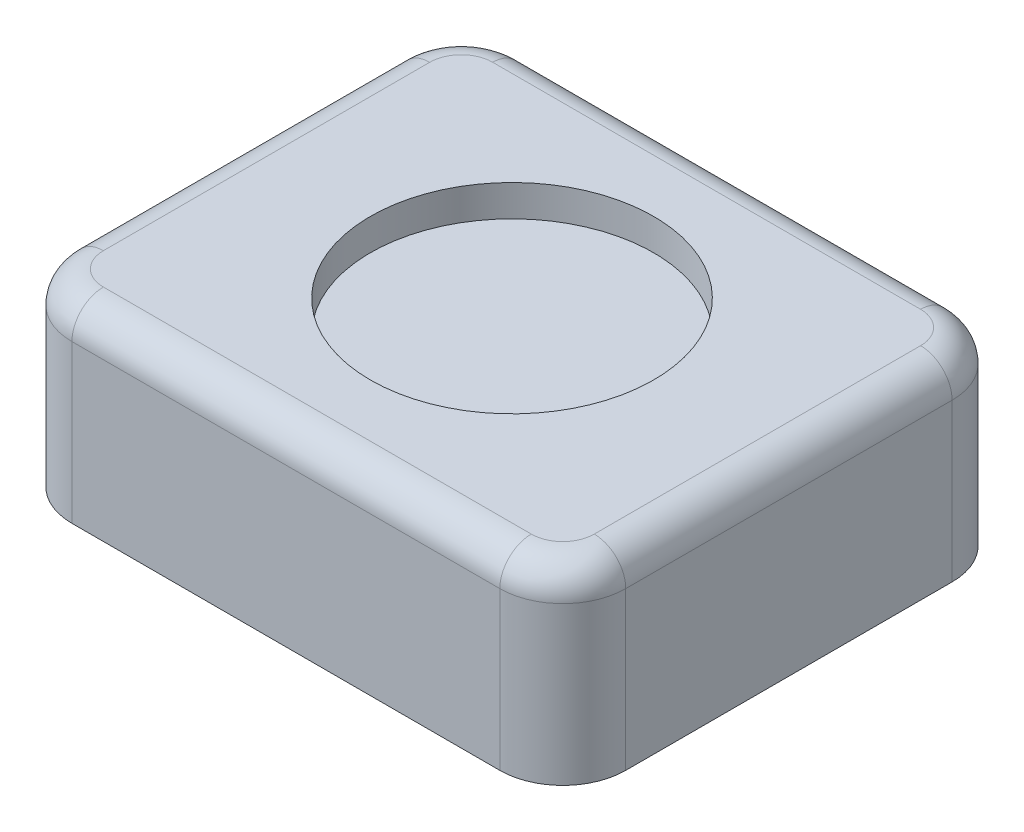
ISO-10303-21;
HEADER;
FILE_DESCRIPTION(('STEP AP214'),'2;1');
FILE_NAME('part.step','',(''),(''),'','','');
FILE_SCHEMA(('AUTOMOTIVE_DESIGN { 1 0 10303 214 1 1 1 1 }'));
ENDSEC;
DATA;
#1=APPLICATION_CONTEXT('core data for automotive mechanical design processes');
#2=APPLICATION_PROTOCOL_DEFINITION('international standard','automotive_design',2000,#1);
#3=PRODUCT_CONTEXT('',#1,'mechanical');
#4=PRODUCT('Part','Part','',(#3));
#5=PRODUCT_RELATED_PRODUCT_CATEGORY('part','',(#4));
#6=PRODUCT_DEFINITION_FORMATION('','',#4);
#7=PRODUCT_DEFINITION_CONTEXT('part definition',#1,'design');
#8=PRODUCT_DEFINITION('design','',#6,#7);
#9=PRODUCT_DEFINITION_SHAPE('','',#8);
#10=(LENGTH_UNIT() NAMED_UNIT(*) SI_UNIT(.MILLI.,.METRE.));
#11=(NAMED_UNIT(*) PLANE_ANGLE_UNIT() SI_UNIT($,.RADIAN.));
#12=(NAMED_UNIT(*) SI_UNIT($,.STERADIAN.) SOLID_ANGLE_UNIT());
#13=UNCERTAINTY_MEASURE_WITH_UNIT(LENGTH_MEASURE(1.E-05),#10,'distance_accuracy_value','');
#14=(GEOMETRIC_REPRESENTATION_CONTEXT(3) GLOBAL_UNCERTAINTY_ASSIGNED_CONTEXT((#13)) GLOBAL_UNIT_ASSIGNED_CONTEXT((#10,
#11,#12)) REPRESENTATION_CONTEXT('',''));
#15=CARTESIAN_POINT('',(0.,0.,0.));
#16=DIRECTION('',(0.,0.,1.));
#17=DIRECTION('',(1.,0.,0.));
#18=AXIS2_PLACEMENT_3D('',#15,#16,#17);
#19=CARTESIAN_POINT('',(0.,30.,0.));
#20=DIRECTION('',(1.,0.,0.));
#21=DIRECTION('',(0.,0.,-1.));
#22=AXIS2_PLACEMENT_3D('',#19,#20,#21);
#23=PLANE('',#22);
#24=DIRECTION('',(0.,-1.,0.));
#25=VECTOR('',#24,1.);
#26=CARTESIAN_POINT('',(0.,30.,-10.));
#27=LINE('',#26,#25);
#28=CARTESIAN_POINT('',(0.,0.,-10.));
#29=VERTEX_POINT('',#28);
#30=CARTESIAN_POINT('',(0.,25.,-10.));
#31=VERTEX_POINT('',#30);
#32=EDGE_CURVE('E135',#29,#31,#27,.F.);
#33=ORIENTED_EDGE('',*,*,#32,.T.);
#34=DIRECTION('',(0.,0.,1.));
#35=VECTOR('',#34,1.);
#36=CARTESIAN_POINT('',(0.,25.,0.));
#37=LINE('',#36,#35);
#38=CARTESIAN_POINT('',(0.,25.,-61.8233067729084));
#39=VERTEX_POINT('',#38);
#40=EDGE_CURVE('E131',#31,#39,#37,.F.);
#41=ORIENTED_EDGE('',*,*,#40,.T.);
#42=DIRECTION('',(0.,-1.,0.));
#43=VECTOR('',#42,1.);
#44=CARTESIAN_POINT('',(0.,30.,-61.8233067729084));
#45=LINE('',#44,#43);
#46=CARTESIAN_POINT('',(0.,0.,-61.8233067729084));
#47=VERTEX_POINT('',#46);
#48=EDGE_CURVE('E124',#39,#47,#45,.T.);
#49=ORIENTED_EDGE('',*,*,#48,.T.);
#50=DIRECTION('',(0.,0.,1.));
#51=VECTOR('',#50,1.);
#52=CARTESIAN_POINT('',(0.,0.,0.));
#53=LINE('',#52,#51);
#54=EDGE_CURVE('E128',#47,#29,#53,.T.);
#55=ORIENTED_EDGE('',*,*,#54,.T.);
#56=EDGE_LOOP('',(#33,#41,#49,#55));
#57=FACE_BOUND('',#56,.T.);
#58=ADVANCED_FACE('F33',(#57),#23,.F.);
#59=CARTESIAN_POINT('',(0.,30.,0.));
#60=DIRECTION('',(0.,0.,-1.));
#61=DIRECTION('',(-1.,0.,0.));
#62=AXIS2_PLACEMENT_3D('',#59,#60,#61);
#63=PLANE('',#62);
#64=DIRECTION('',(0.,-1.,0.));
#65=VECTOR('',#64,1.);
#66=CARTESIAN_POINT('',(77.9512948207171,30.,0.));
#67=LINE('',#66,#65);
#68=CARTESIAN_POINT('',(77.9512948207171,0.,0.));
#69=VERTEX_POINT('',#68);
#70=CARTESIAN_POINT('',(77.9512948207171,25.,0.));
#71=VERTEX_POINT('',#70);
#72=EDGE_CURVE('E179',#69,#71,#67,.F.);
#73=ORIENTED_EDGE('',*,*,#72,.T.);
#74=DIRECTION('',(1.,0.,0.));
#75=VECTOR('',#74,1.);
#76=CARTESIAN_POINT('',(0.,25.,0.));
#77=LINE('',#76,#75);
#78=CARTESIAN_POINT('',(10.,25.,0.));
#79=VERTEX_POINT('',#78);
#80=EDGE_CURVE('E11',#71,#79,#77,.F.);
#81=ORIENTED_EDGE('',*,*,#80,.T.);
#82=DIRECTION('',(0.,-1.,0.));
#83=VECTOR('',#82,1.);
#84=CARTESIAN_POINT('',(10.,30.,0.));
#85=LINE('',#84,#83);
#86=CARTESIAN_POINT('',(10.,0.,0.));
#87=VERTEX_POINT('',#86);
#88=EDGE_CURVE('E177',#79,#87,#85,.T.);
#89=ORIENTED_EDGE('',*,*,#88,.T.);
#90=DIRECTION('',(1.,0.,0.));
#91=VECTOR('',#90,1.);
#92=CARTESIAN_POINT('',(0.,0.,0.));
#93=LINE('',#92,#91);
#94=EDGE_CURVE('E151',#87,#69,#93,.T.);
#95=ORIENTED_EDGE('',*,*,#94,.T.);
#96=EDGE_LOOP('',(#73,#81,#89,#95));
#97=FACE_BOUND('',#96,.T.);
#98=ADVANCED_FACE('F251',(#97),#63,.F.);
#99=CARTESIAN_POINT('',(87.9512948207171,30.,0.));
#100=DIRECTION('',(-1.,0.,0.));
#101=DIRECTION('',(0.,0.,1.));
#102=AXIS2_PLACEMENT_3D('',#99,#100,#101);
#103=PLANE('',#102);
#104=DIRECTION('',(0.,-1.,0.));
#105=VECTOR('',#104,1.);
#106=CARTESIAN_POINT('',(87.9512948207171,30.,-61.8233067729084));
#107=LINE('',#106,#105);
#108=CARTESIAN_POINT('',(87.9512948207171,0.,-61.8233067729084));
#109=VERTEX_POINT('',#108);
#110=CARTESIAN_POINT('',(87.9512948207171,25.,-61.8233067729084));
#111=VERTEX_POINT('',#110);
#112=EDGE_CURVE('E175',#109,#111,#107,.F.);
#113=ORIENTED_EDGE('',*,*,#112,.T.);
#114=DIRECTION('',(0.,0.,-1.));
#115=VECTOR('',#114,1.);
#116=CARTESIAN_POINT('',(87.9512948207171,25.,0.));
#117=LINE('',#116,#115);
#118=CARTESIAN_POINT('',(87.9512948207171,25.,-10.));
#119=VERTEX_POINT('',#118);
#120=EDGE_CURVE('E57',#111,#119,#117,.F.);
#121=ORIENTED_EDGE('',*,*,#120,.T.);
#122=DIRECTION('',(0.,-1.,0.));
#123=VECTOR('',#122,1.);
#124=CARTESIAN_POINT('',(87.9512948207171,30.,-10.));
#125=LINE('',#124,#123);
#126=CARTESIAN_POINT('',(87.9512948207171,0.,-10.));
#127=VERTEX_POINT('',#126);
#128=EDGE_CURVE('E173',#119,#127,#125,.T.);
#129=ORIENTED_EDGE('',*,*,#128,.T.);
#130=DIRECTION('',(0.,0.,-1.));
#131=VECTOR('',#130,1.);
#132=CARTESIAN_POINT('',(87.9512948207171,0.,0.));
#133=LINE('',#132,#131);
#134=EDGE_CURVE('E154',#127,#109,#133,.T.);
#135=ORIENTED_EDGE('',*,*,#134,.T.);
#136=EDGE_LOOP('',(#113,#121,#129,#135));
#137=FACE_BOUND('',#136,.T.);
#138=ADVANCED_FACE('F283',(#137),#103,.F.);
#139=CARTESIAN_POINT('',(0.,30.,-71.8233067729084));
#140=DIRECTION('',(0.,0.,1.));
#141=DIRECTION('',(1.,0.,0.));
#142=AXIS2_PLACEMENT_3D('',#139,#140,#141);
#143=PLANE('',#142);
#144=DIRECTION('',(0.,-1.,0.));
#145=VECTOR('',#144,1.);
#146=CARTESIAN_POINT('',(10.,30.,-71.8233067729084));
#147=LINE('',#146,#145);
#148=CARTESIAN_POINT('',(10.,0.,-71.8233067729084));
#149=VERTEX_POINT('',#148);
#150=CARTESIAN_POINT('',(10.,25.,-71.8233067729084));
#151=VERTEX_POINT('',#150);
#152=EDGE_CURVE('E141',#149,#151,#147,.F.);
#153=ORIENTED_EDGE('',*,*,#152,.T.);
#154=DIRECTION('',(-1.,0.,0.));
#155=VECTOR('',#154,1.);
#156=CARTESIAN_POINT('',(0.,25.,-71.8233067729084));
#157=LINE('',#156,#155);
#158=CARTESIAN_POINT('',(77.9512948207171,25.,-71.8233067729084));
#159=VERTEX_POINT('',#158);
#160=EDGE_CURVE('E204',#151,#159,#157,.F.);
#161=ORIENTED_EDGE('',*,*,#160,.T.);
#162=DIRECTION('',(0.,-1.,0.));
#163=VECTOR('',#162,1.);
#164=CARTESIAN_POINT('',(77.9512948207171,30.,-71.8233067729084));
#165=LINE('',#164,#163);
#166=CARTESIAN_POINT('',(77.9512948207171,0.,-71.8233067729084));
#167=VERTEX_POINT('',#166);
#168=EDGE_CURVE('E145',#159,#167,#165,.T.);
#169=ORIENTED_EDGE('',*,*,#168,.T.);
#170=DIRECTION('',(-1.,0.,0.));
#171=VECTOR('',#170,1.);
#172=CARTESIAN_POINT('',(0.,0.,-71.8233067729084));
#173=LINE('',#172,#171);
#174=EDGE_CURVE('E164',#167,#149,#173,.T.);
#175=ORIENTED_EDGE('',*,*,#174,.T.);
#176=EDGE_LOOP('',(#153,#161,#169,#175));
#177=FACE_BOUND('',#176,.T.);
#178=ADVANCED_FACE('F268',(#177),#143,.F.);
#179=CARTESIAN_POINT('',(0.,30.,-71.8233067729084));
#180=DIRECTION('',(0.,-1.,0.));
#181=DIRECTION('',(0.,0.,-1.));
#182=AXIS2_PLACEMENT_3D('',#179,#180,#181);
#183=PLANE('',#182);
#184=CARTESIAN_POINT('',(43.9756474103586,30.,-35.9116533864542));
#185=DIRECTION('',(0.,1.,0.));
#186=DIRECTION('',(0.,0.,1.));
#187=AXIS2_PLACEMENT_3D('',#184,#185,#186);
#188=CIRCLE('',#187,22.5);
#189=CARTESIAN_POINT('',(43.9756474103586,30.,-13.4116533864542));
#190=VERTEX_POINT('',#189);
#191=EDGE_CURVE('E159',#190,#190,#188,.T.);
#192=ORIENTED_EDGE('',*,*,#191,.F.);
#193=EDGE_LOOP('',(#192));
#194=FACE_BOUND('',#193,.T.);
#195=DIRECTION('',(0.,0.,1.));
#196=VECTOR('',#195,1.);
#197=CARTESIAN_POINT('',(5.,30.,-71.8233067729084));
#198=LINE('',#197,#196);
#199=CARTESIAN_POINT('',(5.,30.,-61.8233067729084));
#200=VERTEX_POINT('',#199);
#201=CARTESIAN_POINT('',(5.,30.,-10.));
#202=VERTEX_POINT('',#201);
#203=EDGE_CURVE('E193',#200,#202,#198,.T.);
#204=ORIENTED_EDGE('',*,*,#203,.T.);
#205=CARTESIAN_POINT('',(10.,30.,-10.));
#206=DIRECTION('',(0.,-1.,0.));
#207=DIRECTION('',(0.,0.,-1.));
#208=AXIS2_PLACEMENT_3D('',#205,#206,#207);
#209=CIRCLE('',#208,5.);
#210=CARTESIAN_POINT('',(10.,30.,-5.));
#211=VERTEX_POINT('',#210);
#212=EDGE_CURVE('E195',#202,#211,#209,.F.);
#213=ORIENTED_EDGE('',*,*,#212,.T.);
#214=DIRECTION('',(1.,0.,0.));
#215=VECTOR('',#214,1.);
#216=CARTESIAN_POINT('',(0.,30.,-5.));
#217=LINE('',#216,#215);
#218=CARTESIAN_POINT('',(77.9512948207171,30.,-5.));
#219=VERTEX_POINT('',#218);
#220=EDGE_CURVE('E181',#211,#219,#217,.T.);
#221=ORIENTED_EDGE('',*,*,#220,.T.);
#222=CARTESIAN_POINT('',(77.9512948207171,30.,-10.));
#223=DIRECTION('',(0.,-1.,0.));
#224=DIRECTION('',(0.,0.,-1.));
#225=AXIS2_PLACEMENT_3D('',#222,#223,#224);
#226=CIRCLE('',#225,5.);
#227=CARTESIAN_POINT('',(82.9512948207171,30.,-10.));
#228=VERTEX_POINT('',#227);
#229=EDGE_CURVE('E183',#219,#228,#226,.F.);
#230=ORIENTED_EDGE('',*,*,#229,.T.);
#231=DIRECTION('',(0.,0.,-1.));
#232=VECTOR('',#231,1.);
#233=CARTESIAN_POINT('',(82.9512948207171,30.,-71.8233067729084));
#234=LINE('',#233,#232);
#235=CARTESIAN_POINT('',(82.9512948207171,30.,-61.8233067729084));
#236=VERTEX_POINT('',#235);
#237=EDGE_CURVE('E185',#228,#236,#234,.T.);
#238=ORIENTED_EDGE('',*,*,#237,.T.);
#239=CARTESIAN_POINT('',(77.9512948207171,30.,-61.8233067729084));
#240=DIRECTION('',(0.,-1.,0.));
#241=DIRECTION('',(0.,0.,-1.));
#242=AXIS2_PLACEMENT_3D('',#239,#240,#241);
#243=CIRCLE('',#242,5.);
#244=CARTESIAN_POINT('',(77.9512948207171,30.,-66.8233067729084));
#245=VERTEX_POINT('',#244);
#246=EDGE_CURVE('E187',#236,#245,#243,.F.);
#247=ORIENTED_EDGE('',*,*,#246,.T.);
#248=DIRECTION('',(-1.,0.,0.));
#249=VECTOR('',#248,1.);
#250=CARTESIAN_POINT('',(0.,30.,-66.8233067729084));
#251=LINE('',#250,#249);
#252=CARTESIAN_POINT('',(10.,30.,-66.8233067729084));
#253=VERTEX_POINT('',#252);
#254=EDGE_CURVE('E189',#245,#253,#251,.T.);
#255=ORIENTED_EDGE('',*,*,#254,.T.);
#256=CARTESIAN_POINT('',(10.,30.,-61.8233067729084));
#257=DIRECTION('',(0.,-1.,0.));
#258=DIRECTION('',(0.,0.,-1.));
#259=AXIS2_PLACEMENT_3D('',#256,#257,#258);
#260=CIRCLE('',#259,5.);
#261=EDGE_CURVE('E191',#253,#200,#260,.F.);
#262=ORIENTED_EDGE('',*,*,#261,.T.);
#263=EDGE_LOOP('',(#204,#213,#221,#230,#238,#247,#255,#262));
#264=FACE_BOUND('',#263,.T.);
#265=ADVANCED_FACE('F238',(#194,#264),#183,.F.);
#266=CARTESIAN_POINT('',(0.,0.,-71.8233067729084));
#267=DIRECTION('',(0.,-1.,0.));
#268=DIRECTION('',(0.,0.,-1.));
#269=AXIS2_PLACEMENT_3D('',#266,#267,#268);
#270=PLANE('',#269);
#271=ORIENTED_EDGE('',*,*,#54,.F.);
#272=CARTESIAN_POINT('',(10.,0.,-61.8233067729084));
#273=DIRECTION('',(0.,-1.,0.));
#274=DIRECTION('',(0.,0.,-1.));
#275=AXIS2_PLACEMENT_3D('',#272,#273,#274);
#276=CIRCLE('',#275,10.);
#277=EDGE_CURVE('E138',#47,#149,#276,.T.);
#278=ORIENTED_EDGE('',*,*,#277,.T.);
#279=ORIENTED_EDGE('',*,*,#174,.F.);
#280=CARTESIAN_POINT('',(77.9512948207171,0.,-61.8233067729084));
#281=DIRECTION('',(0.,-1.,0.));
#282=DIRECTION('',(0.,0.,-1.));
#283=AXIS2_PLACEMENT_3D('',#280,#281,#282);
#284=CIRCLE('',#283,10.);
#285=EDGE_CURVE('E146',#167,#109,#284,.T.);
#286=ORIENTED_EDGE('',*,*,#285,.T.);
#287=ORIENTED_EDGE('',*,*,#134,.F.);
#288=CARTESIAN_POINT('',(77.9512948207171,0.,-10.));
#289=DIRECTION('',(0.,-1.,0.));
#290=DIRECTION('',(0.,0.,-1.));
#291=AXIS2_PLACEMENT_3D('',#288,#289,#290);
#292=CIRCLE('',#291,10.);
#293=EDGE_CURVE('E168',#127,#69,#292,.T.);
#294=ORIENTED_EDGE('',*,*,#293,.T.);
#295=ORIENTED_EDGE('',*,*,#94,.F.);
#296=CARTESIAN_POINT('',(10.,0.,-10.));
#297=DIRECTION('',(0.,-1.,0.));
#298=DIRECTION('',(0.,0.,-1.));
#299=AXIS2_PLACEMENT_3D('',#296,#297,#298);
#300=CIRCLE('',#299,10.);
#301=EDGE_CURVE('E134',#87,#29,#300,.T.);
#302=ORIENTED_EDGE('',*,*,#301,.T.);
#303=EDGE_LOOP('',(#271,#278,#279,#286,#287,#294,#295,#302));
#304=FACE_BOUND('',#303,.T.);
#305=ADVANCED_FACE('F148',(#304),#270,.T.);
#306=CARTESIAN_POINT('',(10.,30.,-61.8233067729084));
#307=DIRECTION('',(0.,-1.,0.));
#308=DIRECTION('',(0.,0.,-1.));
#309=AXIS2_PLACEMENT_3D('',#306,#307,#308);
#310=CYLINDRICAL_SURFACE('',#309,10.);
#311=ORIENTED_EDGE('',*,*,#48,.F.);
#312=CARTESIAN_POINT('',(10.,25.,-61.8233067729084));
#313=DIRECTION('',(0.,-1.,0.));
#314=DIRECTION('',(0.,0.,-1.));
#315=AXIS2_PLACEMENT_3D('',#312,#313,#314);
#316=CIRCLE('',#315,10.);
#317=EDGE_CURVE('E202',#39,#151,#316,.T.);
#318=ORIENTED_EDGE('',*,*,#317,.T.);
#319=ORIENTED_EDGE('',*,*,#152,.F.);
#320=ORIENTED_EDGE('',*,*,#277,.F.);
#321=EDGE_LOOP('',(#311,#318,#319,#320));
#322=FACE_BOUND('',#321,.T.);
#323=ADVANCED_FACE('F139',(#322),#310,.T.);
#324=CARTESIAN_POINT('',(77.9512948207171,30.,-61.8233067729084));
#325=DIRECTION('',(0.,-1.,0.));
#326=DIRECTION('',(0.,0.,-1.));
#327=AXIS2_PLACEMENT_3D('',#324,#325,#326);
#328=CYLINDRICAL_SURFACE('',#327,10.);
#329=ORIENTED_EDGE('',*,*,#168,.F.);
#330=CARTESIAN_POINT('',(77.9512948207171,25.,-61.8233067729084));
#331=DIRECTION('',(0.,-1.,0.));
#332=DIRECTION('',(0.,0.,-1.));
#333=AXIS2_PLACEMENT_3D('',#330,#331,#332);
#334=CIRCLE('',#333,10.);
#335=EDGE_CURVE('E206',#159,#111,#334,.T.);
#336=ORIENTED_EDGE('',*,*,#335,.T.);
#337=ORIENTED_EDGE('',*,*,#112,.F.);
#338=ORIENTED_EDGE('',*,*,#285,.F.);
#339=EDGE_LOOP('',(#329,#336,#337,#338));
#340=FACE_BOUND('',#339,.T.);
#341=ADVANCED_FACE('F289',(#340),#328,.T.);
#342=CARTESIAN_POINT('',(77.9512948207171,30.,-10.));
#343=DIRECTION('',(0.,-1.,0.));
#344=DIRECTION('',(0.,0.,-1.));
#345=AXIS2_PLACEMENT_3D('',#342,#343,#344);
#346=CYLINDRICAL_SURFACE('',#345,10.);
#347=ORIENTED_EDGE('',*,*,#128,.F.);
#348=CARTESIAN_POINT('',(77.9512948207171,25.,-10.));
#349=DIRECTION('',(0.,-1.,0.));
#350=DIRECTION('',(0.,0.,-1.));
#351=AXIS2_PLACEMENT_3D('',#348,#349,#350);
#352=CIRCLE('',#351,10.);
#353=EDGE_CURVE('E42',#119,#71,#352,.T.);
#354=ORIENTED_EDGE('',*,*,#353,.T.);
#355=ORIENTED_EDGE('',*,*,#72,.F.);
#356=ORIENTED_EDGE('',*,*,#293,.F.);
#357=EDGE_LOOP('',(#347,#354,#355,#356));
#358=FACE_BOUND('',#357,.T.);
#359=ADVANCED_FACE('F292',(#358),#346,.T.);
#360=CARTESIAN_POINT('',(10.,30.,-10.));
#361=DIRECTION('',(0.,-1.,0.));
#362=DIRECTION('',(0.,0.,-1.));
#363=AXIS2_PLACEMENT_3D('',#360,#361,#362);
#364=CYLINDRICAL_SURFACE('',#363,10.);
#365=ORIENTED_EDGE('',*,*,#88,.F.);
#366=CARTESIAN_POINT('',(10.,25.,-10.));
#367=DIRECTION('',(0.,-1.,0.));
#368=DIRECTION('',(0.,0.,-1.));
#369=AXIS2_PLACEMENT_3D('',#366,#367,#368);
#370=CIRCLE('',#369,10.);
#371=EDGE_CURVE('E198',#79,#31,#370,.T.);
#372=ORIENTED_EDGE('',*,*,#371,.T.);
#373=ORIENTED_EDGE('',*,*,#32,.F.);
#374=ORIENTED_EDGE('',*,*,#301,.F.);
#375=EDGE_LOOP('',(#365,#372,#373,#374));
#376=FACE_BOUND('',#375,.T.);
#377=ADVANCED_FACE('F254',(#376),#364,.T.);
#378=CARTESIAN_POINT('',(77.9512948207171,25.,-61.8233067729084));
#379=DIRECTION('',(0.,-1.,0.));
#380=DIRECTION('',(0.,0.,-1.));
#381=AXIS2_PLACEMENT_3D('',#378,#379,#380);
#382=DEGENERATE_TOROIDAL_SURFACE('',#381,5.,5.,.T.);
#383=CARTESIAN_POINT('',(82.9512948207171,25.,-61.8233067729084));
#384=DIRECTION('',(0.,0.,1.));
#385=DIRECTION('',(1.,0.,0.));
#386=AXIS2_PLACEMENT_3D('',#383,#384,#385);
#387=CIRCLE('',#386,5.);
#388=EDGE_CURVE('E157',#111,#236,#387,.T.);
#389=ORIENTED_EDGE('',*,*,#388,.F.);
#390=ORIENTED_EDGE('',*,*,#335,.F.);
#391=CARTESIAN_POINT('',(77.9512948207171,25.,-66.8233067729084));
#392=DIRECTION('',(-1.,0.,0.));
#393=DIRECTION('',(0.,0.,1.));
#394=AXIS2_PLACEMENT_3D('',#391,#392,#393);
#395=CIRCLE('',#394,5.);
#396=EDGE_CURVE('E37',#245,#159,#395,.T.);
#397=ORIENTED_EDGE('',*,*,#396,.F.);
#398=ORIENTED_EDGE('',*,*,#246,.F.);
#399=EDGE_LOOP('',(#389,#390,#397,#398));
#400=FACE_BOUND('',#399,.T.);
#401=ADVANCED_FACE('F35',(#400),#382,.T.);
#402=CARTESIAN_POINT('',(0.,25.,-66.8233067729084));
#403=DIRECTION('',(-1.,0.,0.));
#404=DIRECTION('',(0.,0.,1.));
#405=AXIS2_PLACEMENT_3D('',#402,#403,#404);
#406=CYLINDRICAL_SURFACE('',#405,5.);
#407=ORIENTED_EDGE('',*,*,#396,.T.);
#408=ORIENTED_EDGE('',*,*,#160,.F.);
#409=CARTESIAN_POINT('',(10.,25.,-66.8233067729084));
#410=DIRECTION('',(-1.,0.,0.));
#411=DIRECTION('',(0.,0.,1.));
#412=AXIS2_PLACEMENT_3D('',#409,#410,#411);
#413=CIRCLE('',#412,5.);
#414=EDGE_CURVE('E224',#253,#151,#413,.T.);
#415=ORIENTED_EDGE('',*,*,#414,.F.);
#416=ORIENTED_EDGE('',*,*,#254,.F.);
#417=EDGE_LOOP('',(#407,#408,#415,#416));
#418=FACE_BOUND('',#417,.T.);
#419=ADVANCED_FACE('F271',(#418),#406,.T.);
#420=CARTESIAN_POINT('',(82.9512948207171,25.,-71.8233067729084));
#421=DIRECTION('',(0.,0.,-1.));
#422=DIRECTION('',(-1.,0.,0.));
#423=AXIS2_PLACEMENT_3D('',#420,#421,#422);
#424=CYLINDRICAL_SURFACE('',#423,5.);
#425=ORIENTED_EDGE('',*,*,#388,.T.);
#426=ORIENTED_EDGE('',*,*,#237,.F.);
#427=CARTESIAN_POINT('',(82.9512948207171,25.,-10.));
#428=DIRECTION('',(0.,0.,1.));
#429=DIRECTION('',(1.,0.,0.));
#430=AXIS2_PLACEMENT_3D('',#427,#428,#429);
#431=CIRCLE('',#430,5.);
#432=EDGE_CURVE('E221',#119,#228,#431,.T.);
#433=ORIENTED_EDGE('',*,*,#432,.F.);
#434=ORIENTED_EDGE('',*,*,#120,.F.);
#435=EDGE_LOOP('',(#425,#426,#433,#434));
#436=FACE_BOUND('',#435,.T.);
#437=ADVANCED_FACE('F230',(#436),#424,.T.);
#438=CARTESIAN_POINT('',(10.,25.,-61.8233067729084));
#439=DIRECTION('',(0.,-1.,0.));
#440=DIRECTION('',(0.,0.,-1.));
#441=AXIS2_PLACEMENT_3D('',#438,#439,#440);
#442=DEGENERATE_TOROIDAL_SURFACE('',#441,5.,5.,.T.);
#443=ORIENTED_EDGE('',*,*,#414,.T.);
#444=ORIENTED_EDGE('',*,*,#317,.F.);
#445=CARTESIAN_POINT('',(5.,25.,-61.8233067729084));
#446=DIRECTION('',(0.,0.,1.));
#447=DIRECTION('',(1.,0.,0.));
#448=AXIS2_PLACEMENT_3D('',#445,#446,#447);
#449=CIRCLE('',#448,5.);
#450=EDGE_CURVE('E218',#200,#39,#449,.T.);
#451=ORIENTED_EDGE('',*,*,#450,.F.);
#452=ORIENTED_EDGE('',*,*,#261,.F.);
#453=EDGE_LOOP('',(#443,#444,#451,#452));
#454=FACE_BOUND('',#453,.T.);
#455=ADVANCED_FACE('F265',(#454),#442,.T.);
#456=CARTESIAN_POINT('',(77.9512948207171,25.,-10.));
#457=DIRECTION('',(0.,-1.,0.));
#458=DIRECTION('',(0.,0.,-1.));
#459=AXIS2_PLACEMENT_3D('',#456,#457,#458);
#460=DEGENERATE_TOROIDAL_SURFACE('',#459,5.,5.,.T.);
#461=ORIENTED_EDGE('',*,*,#432,.T.);
#462=ORIENTED_EDGE('',*,*,#229,.F.);
#463=CARTESIAN_POINT('',(77.9512948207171,25.,-5.));
#464=DIRECTION('',(-1.,0.,0.));
#465=DIRECTION('',(0.,0.,1.));
#466=AXIS2_PLACEMENT_3D('',#463,#464,#465);
#467=CIRCLE('',#466,5.);
#468=EDGE_CURVE('E215',#71,#219,#467,.T.);
#469=ORIENTED_EDGE('',*,*,#468,.F.);
#470=ORIENTED_EDGE('',*,*,#353,.F.);
#471=EDGE_LOOP('',(#461,#462,#469,#470));
#472=FACE_BOUND('',#471,.T.);
#473=ADVANCED_FACE('F244',(#472),#460,.T.);
#474=CARTESIAN_POINT('',(5.,25.,-71.8233067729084));
#475=DIRECTION('',(0.,0.,1.));
#476=DIRECTION('',(1.,0.,0.));
#477=AXIS2_PLACEMENT_3D('',#474,#475,#476);
#478=CYLINDRICAL_SURFACE('',#477,5.);
#479=ORIENTED_EDGE('',*,*,#450,.T.);
#480=ORIENTED_EDGE('',*,*,#40,.F.);
#481=CARTESIAN_POINT('',(5.,25.,-10.));
#482=DIRECTION('',(0.,0.,1.));
#483=DIRECTION('',(1.,0.,0.));
#484=AXIS2_PLACEMENT_3D('',#481,#482,#483);
#485=CIRCLE('',#484,5.);
#486=EDGE_CURVE('E212',#202,#31,#485,.T.);
#487=ORIENTED_EDGE('',*,*,#486,.F.);
#488=ORIENTED_EDGE('',*,*,#203,.F.);
#489=EDGE_LOOP('',(#479,#480,#487,#488));
#490=FACE_BOUND('',#489,.T.);
#491=ADVANCED_FACE('F261',(#490),#478,.T.);
#492=CARTESIAN_POINT('',(0.,25.,-5.));
#493=DIRECTION('',(1.,0.,0.));
#494=DIRECTION('',(0.,0.,-1.));
#495=AXIS2_PLACEMENT_3D('',#492,#493,#494);
#496=CYLINDRICAL_SURFACE('',#495,5.);
#497=ORIENTED_EDGE('',*,*,#468,.T.);
#498=ORIENTED_EDGE('',*,*,#220,.F.);
#499=CARTESIAN_POINT('',(10.,25.,-5.));
#500=DIRECTION('',(-1.,0.,0.));
#501=DIRECTION('',(0.,0.,1.));
#502=AXIS2_PLACEMENT_3D('',#499,#500,#501);
#503=CIRCLE('',#502,5.);
#504=EDGE_CURVE('E210',#79,#211,#503,.T.);
#505=ORIENTED_EDGE('',*,*,#504,.F.);
#506=ORIENTED_EDGE('',*,*,#80,.F.);
#507=EDGE_LOOP('',(#497,#498,#505,#506));
#508=FACE_BOUND('',#507,.T.);
#509=ADVANCED_FACE('F247',(#508),#496,.T.);
#510=CARTESIAN_POINT('',(10.,25.,-10.));
#511=DIRECTION('',(0.,-1.,0.));
#512=DIRECTION('',(0.,0.,-1.));
#513=AXIS2_PLACEMENT_3D('',#510,#511,#512);
#514=DEGENERATE_TOROIDAL_SURFACE('',#513,5.,5.,.T.);
#515=ORIENTED_EDGE('',*,*,#486,.T.);
#516=ORIENTED_EDGE('',*,*,#371,.F.);
#517=ORIENTED_EDGE('',*,*,#504,.T.);
#518=ORIENTED_EDGE('',*,*,#212,.F.);
#519=EDGE_LOOP('',(#515,#516,#517,#518));
#520=FACE_BOUND('',#519,.T.);
#521=ADVANCED_FACE('F256',(#520),#514,.T.);
#522=CARTESIAN_POINT('',(43.9756474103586,25.,-35.9116533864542));
#523=DIRECTION('',(0.,1.,0.));
#524=DIRECTION('',(0.,0.,1.));
#525=AXIS2_PLACEMENT_3D('',#522,#523,#524);
#526=CYLINDRICAL_SURFACE('',#525,22.5);
#527=CARTESIAN_POINT('',(43.9756474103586,25.,-35.9116533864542));
#528=DIRECTION('',(0.,1.,0.));
#529=DIRECTION('',(0.,0.,1.));
#530=AXIS2_PLACEMENT_3D('',#527,#528,#529);
#531=CIRCLE('',#530,22.5);
#532=CARTESIAN_POINT('',(43.9756474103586,25.,-13.4116533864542));
#533=VERTEX_POINT('',#532);
#534=EDGE_CURVE('E213',#533,#533,#531,.T.);
#535=ORIENTED_EDGE('',*,*,#534,.F.);
#536=EDGE_LOOP('',(#535));
#537=FACE_BOUND('',#536,.T.);
#538=ORIENTED_EDGE('',*,*,#191,.T.);
#539=EDGE_LOOP('',(#538));
#540=FACE_BOUND('',#539,.T.);
#541=ADVANCED_FACE('F300',(#537,#540),#526,.F.);
#542=CARTESIAN_POINT('',(43.9756474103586,25.,-35.9116533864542));
#543=DIRECTION('',(0.,1.,0.));
#544=DIRECTION('',(0.,0.,1.));
#545=AXIS2_PLACEMENT_3D('',#542,#543,#544);
#546=PLANE('',#545);
#547=ORIENTED_EDGE('',*,*,#534,.T.);
#548=EDGE_LOOP('',(#547));
#549=FACE_BOUND('',#548,.T.);
#550=ADVANCED_FACE('F335',(#549),#546,.T.);
#551=CLOSED_SHELL('',(#58,#98,#138,#178,#265,#305,#323,#341,#359,#377,#401,#419,#437,#455,#473,
#491,#509,#521,#541,#550));
#552=MANIFOLD_SOLID_BREP('B2',#551);
#553=ADVANCED_BREP_SHAPE_REPRESENTATION('',(#18,#552),#14);
#554=SHAPE_DEFINITION_REPRESENTATION(#9,#553);
ENDSEC;
END-ISO-10303-21;
